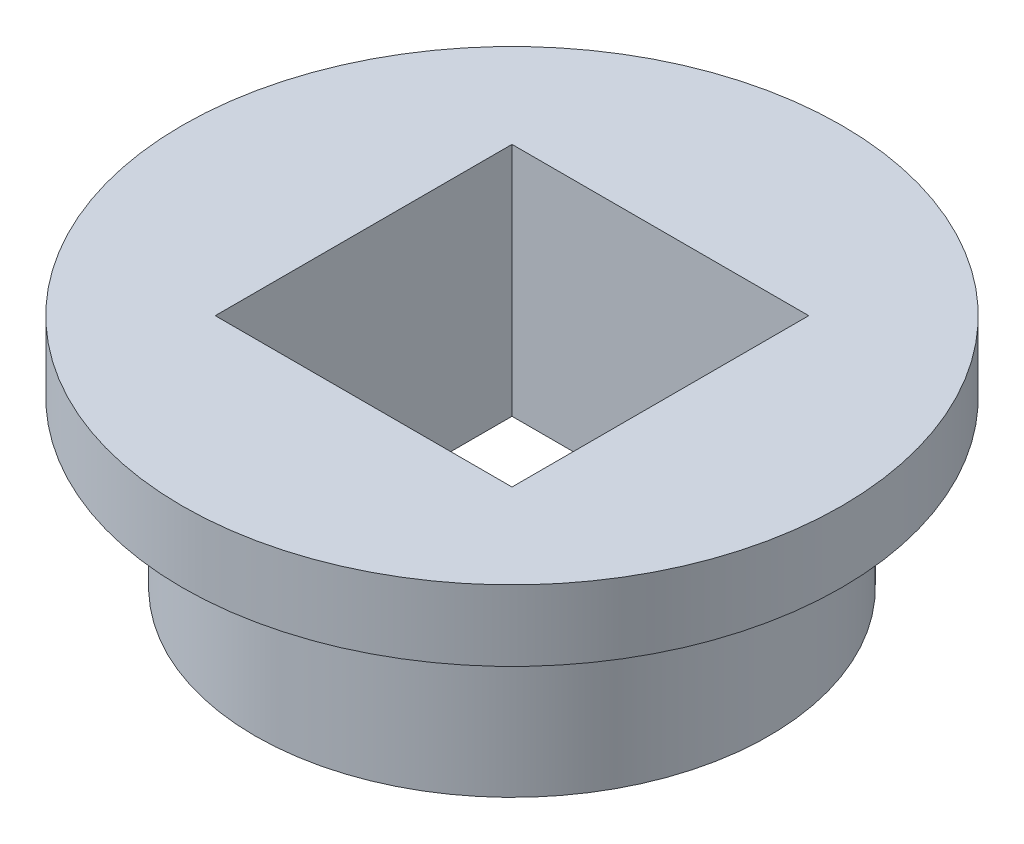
ISO-10303-21;
HEADER;
FILE_DESCRIPTION(('STEP AP214'),'2;1');
FILE_NAME('part.step','',(''),(''),'','','');
FILE_SCHEMA(('AUTOMOTIVE_DESIGN { 1 0 10303 214 1 1 1 1 }'));
ENDSEC;
DATA;
#1=APPLICATION_CONTEXT('core data for automotive mechanical design processes');
#2=APPLICATION_PROTOCOL_DEFINITION('international standard','automotive_design',2000,#1);
#3=PRODUCT_CONTEXT('',#1,'mechanical');
#4=PRODUCT('Part','Part','',(#3));
#5=PRODUCT_RELATED_PRODUCT_CATEGORY('part','',(#4));
#6=PRODUCT_DEFINITION_FORMATION('','',#4);
#7=PRODUCT_DEFINITION_CONTEXT('part definition',#1,'design');
#8=PRODUCT_DEFINITION('design','',#6,#7);
#9=PRODUCT_DEFINITION_SHAPE('','',#8);
#10=(LENGTH_UNIT() NAMED_UNIT(*) SI_UNIT(.MILLI.,.METRE.));
#11=(NAMED_UNIT(*) PLANE_ANGLE_UNIT() SI_UNIT($,.RADIAN.));
#12=(NAMED_UNIT(*) SI_UNIT($,.STERADIAN.) SOLID_ANGLE_UNIT());
#13=UNCERTAINTY_MEASURE_WITH_UNIT(LENGTH_MEASURE(1.E-05),#10,'distance_accuracy_value','');
#14=(GEOMETRIC_REPRESENTATION_CONTEXT(3) GLOBAL_UNCERTAINTY_ASSIGNED_CONTEXT((#13)) GLOBAL_UNIT_ASSIGNED_CONTEXT((#10,
#11,#12)) REPRESENTATION_CONTEXT('',''));
#15=CARTESIAN_POINT('',(0.,0.,0.));
#16=DIRECTION('',(0.,0.,1.));
#17=DIRECTION('',(1.,0.,0.));
#18=AXIS2_PLACEMENT_3D('',#15,#16,#17);
#19=CARTESIAN_POINT('',(6.3,0.,-6.3));
#20=DIRECTION('',(0.,1.,0.));
#21=DIRECTION('',(0.,0.,1.));
#22=AXIS2_PLACEMENT_3D('',#19,#20,#21);
#23=PLANE('',#22);
#24=CARTESIAN_POINT('',(6.3,0.,-6.3));
#25=DIRECTION('',(0.,1.,0.));
#26=DIRECTION('',(0.,0.,1.));
#27=AXIS2_PLACEMENT_3D('',#24,#25,#26);
#28=CIRCLE('',#27,10.91);
#29=CARTESIAN_POINT('',(6.3,0.,4.61));
#30=VERTEX_POINT('',#29);
#31=EDGE_CURVE('E37',#30,#30,#28,.T.);
#32=ORIENTED_EDGE('',*,*,#31,.F.);
#33=EDGE_LOOP('',(#32));
#34=FACE_BOUND('',#33,.T.);
#35=DIRECTION('',(0.,0.,1.));
#36=VECTOR('',#35,1.);
#37=CARTESIAN_POINT('',(0.,0.,0.));
#38=LINE('',#37,#36);
#39=CARTESIAN_POINT('',(0.,0.,-12.6));
#40=VERTEX_POINT('',#39);
#41=CARTESIAN_POINT('',(0.,0.,0.));
#42=VERTEX_POINT('',#41);
#43=EDGE_CURVE('E48',#40,#42,#38,.T.);
#44=ORIENTED_EDGE('',*,*,#43,.T.);
#45=DIRECTION('',(1.,0.,0.));
#46=VECTOR('',#45,1.);
#47=CARTESIAN_POINT('',(0.,0.,0.));
#48=LINE('',#47,#46);
#49=CARTESIAN_POINT('',(12.6,0.,0.));
#50=VERTEX_POINT('',#49);
#51=EDGE_CURVE('E108',#42,#50,#48,.T.);
#52=ORIENTED_EDGE('',*,*,#51,.T.);
#53=DIRECTION('',(0.,0.,-1.));
#54=VECTOR('',#53,1.);
#55=CARTESIAN_POINT('',(12.6,0.,0.));
#56=LINE('',#55,#54);
#57=CARTESIAN_POINT('',(12.6,0.,-12.6));
#58=VERTEX_POINT('',#57);
#59=EDGE_CURVE('E79',#50,#58,#56,.T.);
#60=ORIENTED_EDGE('',*,*,#59,.T.);
#61=DIRECTION('',(-1.,0.,0.));
#62=VECTOR('',#61,1.);
#63=CARTESIAN_POINT('',(0.,0.,-12.6));
#64=LINE('',#63,#62);
#65=EDGE_CURVE('E111',#58,#40,#64,.T.);
#66=ORIENTED_EDGE('',*,*,#65,.T.);
#67=EDGE_LOOP('',(#44,#52,#60,#66));
#68=FACE_BOUND('',#67,.T.);
#69=ADVANCED_FACE('F33',(#34,#68),#23,.F.);
#70=CARTESIAN_POINT('',(6.3,7.,-6.3));
#71=DIRECTION('',(0.,-1.,0.));
#72=DIRECTION('',(0.,0.,-1.));
#73=AXIS2_PLACEMENT_3D('',#70,#71,#72);
#74=CYLINDRICAL_SURFACE('',#73,10.91);
#75=CARTESIAN_POINT('',(6.3,7.,-6.3));
#76=DIRECTION('',(0.,1.,0.));
#77=DIRECTION('',(0.,0.,1.));
#78=AXIS2_PLACEMENT_3D('',#75,#76,#77);
#79=CIRCLE('',#78,10.91);
#80=CARTESIAN_POINT('',(6.3,7.,4.61));
#81=VERTEX_POINT('',#80);
#82=EDGE_CURVE('E11',#81,#81,#79,.T.);
#83=ORIENTED_EDGE('',*,*,#82,.F.);
#84=EDGE_LOOP('',(#83));
#85=FACE_BOUND('',#84,.T.);
#86=ORIENTED_EDGE('',*,*,#31,.T.);
#87=EDGE_LOOP('',(#86));
#88=FACE_BOUND('',#87,.T.);
#89=ADVANCED_FACE('F35',(#85,#88),#74,.T.);
#90=CARTESIAN_POINT('',(0.,7.,0.));
#91=DIRECTION('',(1.,0.,0.));
#92=DIRECTION('',(0.,0.,-1.));
#93=AXIS2_PLACEMENT_3D('',#90,#91,#92);
#94=PLANE('',#93);
#95=ORIENTED_EDGE('',*,*,#43,.F.);
#96=DIRECTION('',(0.,-1.,0.));
#97=VECTOR('',#96,1.);
#98=CARTESIAN_POINT('',(0.,7.,-12.6));
#99=LINE('',#98,#97);
#100=CARTESIAN_POINT('',(0.,10.,-12.6));
#101=VERTEX_POINT('',#100);
#102=EDGE_CURVE('E114',#101,#40,#99,.T.);
#103=ORIENTED_EDGE('',*,*,#102,.F.);
#104=DIRECTION('',(0.,0.,-1.));
#105=VECTOR('',#104,1.);
#106=CARTESIAN_POINT('',(0.,10.,0.));
#107=LINE('',#106,#105);
#108=CARTESIAN_POINT('',(0.,10.,0.));
#109=VERTEX_POINT('',#108);
#110=EDGE_CURVE('E90',#109,#101,#107,.T.);
#111=ORIENTED_EDGE('',*,*,#110,.F.);
#112=DIRECTION('',(0.,-1.,0.));
#113=VECTOR('',#112,1.);
#114=CARTESIAN_POINT('',(0.,7.,0.));
#115=LINE('',#114,#113);
#116=EDGE_CURVE('E82',#109,#42,#115,.T.);
#117=ORIENTED_EDGE('',*,*,#116,.T.);
#118=EDGE_LOOP('',(#95,#103,#111,#117));
#119=FACE_BOUND('',#118,.T.);
#120=ADVANCED_FACE('F125',(#119),#94,.T.);
#121=CARTESIAN_POINT('',(0.,7.,0.));
#122=DIRECTION('',(0.,0.,-1.));
#123=DIRECTION('',(-1.,0.,0.));
#124=AXIS2_PLACEMENT_3D('',#121,#122,#123);
#125=PLANE('',#124);
#126=ORIENTED_EDGE('',*,*,#51,.F.);
#127=ORIENTED_EDGE('',*,*,#116,.F.);
#128=DIRECTION('',(-1.,0.,0.));
#129=VECTOR('',#128,1.);
#130=CARTESIAN_POINT('',(0.,10.,0.));
#131=LINE('',#130,#129);
#132=CARTESIAN_POINT('',(12.6,10.,0.));
#133=VERTEX_POINT('',#132);
#134=EDGE_CURVE('E85',#133,#109,#131,.T.);
#135=ORIENTED_EDGE('',*,*,#134,.F.);
#136=DIRECTION('',(0.,-1.,0.));
#137=VECTOR('',#136,1.);
#138=CARTESIAN_POINT('',(12.6,7.,0.));
#139=LINE('',#138,#137);
#140=EDGE_CURVE('E73',#133,#50,#139,.T.);
#141=ORIENTED_EDGE('',*,*,#140,.T.);
#142=EDGE_LOOP('',(#126,#127,#135,#141));
#143=FACE_BOUND('',#142,.T.);
#144=ADVANCED_FACE('F86',(#143),#125,.T.);
#145=CARTESIAN_POINT('',(12.6,7.,0.));
#146=DIRECTION('',(-1.,0.,0.));
#147=DIRECTION('',(0.,0.,1.));
#148=AXIS2_PLACEMENT_3D('',#145,#146,#147);
#149=PLANE('',#148);
#150=ORIENTED_EDGE('',*,*,#59,.F.);
#151=ORIENTED_EDGE('',*,*,#140,.F.);
#152=DIRECTION('',(0.,0.,1.));
#153=VECTOR('',#152,1.);
#154=CARTESIAN_POINT('',(12.6,10.,0.));
#155=LINE('',#154,#153);
#156=CARTESIAN_POINT('',(12.6,10.,-12.6));
#157=VERTEX_POINT('',#156);
#158=EDGE_CURVE('E77',#157,#133,#155,.T.);
#159=ORIENTED_EDGE('',*,*,#158,.F.);
#160=DIRECTION('',(0.,-1.,0.));
#161=VECTOR('',#160,1.);
#162=CARTESIAN_POINT('',(12.6,7.,-12.6));
#163=LINE('',#162,#161);
#164=EDGE_CURVE('E56',#157,#58,#163,.T.);
#165=ORIENTED_EDGE('',*,*,#164,.T.);
#166=EDGE_LOOP('',(#150,#151,#159,#165));
#167=FACE_BOUND('',#166,.T.);
#168=ADVANCED_FACE('F75',(#167),#149,.T.);
#169=CARTESIAN_POINT('',(0.,7.,-12.6));
#170=DIRECTION('',(0.,0.,1.));
#171=DIRECTION('',(1.,0.,0.));
#172=AXIS2_PLACEMENT_3D('',#169,#170,#171);
#173=PLANE('',#172);
#174=ORIENTED_EDGE('',*,*,#65,.F.);
#175=ORIENTED_EDGE('',*,*,#164,.F.);
#176=DIRECTION('',(1.,0.,0.));
#177=VECTOR('',#176,1.);
#178=CARTESIAN_POINT('',(0.,10.,-12.6));
#179=LINE('',#178,#177);
#180=EDGE_CURVE('E96',#101,#157,#179,.T.);
#181=ORIENTED_EDGE('',*,*,#180,.F.);
#182=ORIENTED_EDGE('',*,*,#102,.T.);
#183=EDGE_LOOP('',(#174,#175,#181,#182));
#184=FACE_BOUND('',#183,.T.);
#185=ADVANCED_FACE('F124',(#184),#173,.T.);
#186=CARTESIAN_POINT('',(0.,7.,0.));
#187=DIRECTION('',(0.,1.,0.));
#188=DIRECTION('',(0.,0.,1.));
#189=AXIS2_PLACEMENT_3D('',#186,#187,#188);
#190=PLANE('',#189);
#191=CARTESIAN_POINT('',(6.3,7.,-6.3));
#192=DIRECTION('',(0.,1.,0.));
#193=DIRECTION('',(0.,0.,1.));
#194=AXIS2_PLACEMENT_3D('',#191,#192,#193);
#195=CIRCLE('',#194,14.);
#196=CARTESIAN_POINT('',(6.3,7.,7.7));
#197=VERTEX_POINT('',#196);
#198=EDGE_CURVE('E97',#197,#197,#195,.T.);
#199=ORIENTED_EDGE('',*,*,#198,.F.);
#200=EDGE_LOOP('',(#199));
#201=FACE_BOUND('',#200,.T.);
#202=ORIENTED_EDGE('',*,*,#82,.T.);
#203=EDGE_LOOP('',(#202));
#204=FACE_BOUND('',#203,.T.);
#205=ADVANCED_FACE('F139',(#201,#204),#190,.F.);
#206=CARTESIAN_POINT('',(6.3,10.,-6.3));
#207=DIRECTION('',(0.,-1.,0.));
#208=DIRECTION('',(0.,0.,-1.));
#209=AXIS2_PLACEMENT_3D('',#206,#207,#208);
#210=CYLINDRICAL_SURFACE('',#209,14.);
#211=CARTESIAN_POINT('',(6.3,10.,-6.3));
#212=DIRECTION('',(0.,1.,0.));
#213=DIRECTION('',(0.,0.,1.));
#214=AXIS2_PLACEMENT_3D('',#211,#212,#213);
#215=CIRCLE('',#214,14.);
#216=CARTESIAN_POINT('',(6.3,10.,7.7));
#217=VERTEX_POINT('',#216);
#218=EDGE_CURVE('E104',#217,#217,#215,.T.);
#219=ORIENTED_EDGE('',*,*,#218,.F.);
#220=EDGE_LOOP('',(#219));
#221=FACE_BOUND('',#220,.T.);
#222=ORIENTED_EDGE('',*,*,#198,.T.);
#223=EDGE_LOOP('',(#222));
#224=FACE_BOUND('',#223,.T.);
#225=ADVANCED_FACE('F140',(#221,#224),#210,.T.);
#226=CARTESIAN_POINT('',(0.,10.,0.));
#227=DIRECTION('',(0.,1.,0.));
#228=DIRECTION('',(0.,0.,1.));
#229=AXIS2_PLACEMENT_3D('',#226,#227,#228);
#230=PLANE('',#229);
#231=ORIENTED_EDGE('',*,*,#158,.T.);
#232=ORIENTED_EDGE('',*,*,#134,.T.);
#233=ORIENTED_EDGE('',*,*,#110,.T.);
#234=ORIENTED_EDGE('',*,*,#180,.T.);
#235=EDGE_LOOP('',(#231,#232,#233,#234));
#236=FACE_BOUND('',#235,.T.);
#237=ORIENTED_EDGE('',*,*,#218,.T.);
#238=EDGE_LOOP('',(#237));
#239=FACE_BOUND('',#238,.T.);
#240=ADVANCED_FACE('F93',(#236,#239),#230,.T.);
#241=CLOSED_SHELL('',(#69,#89,#120,#144,#168,#185,#205,#225,#240));
#242=MANIFOLD_SOLID_BREP('B2',#241);
#243=ADVANCED_BREP_SHAPE_REPRESENTATION('',(#18,#242),#14);
#244=SHAPE_DEFINITION_REPRESENTATION(#9,#243);
ENDSEC;
END-ISO-10303-21;
